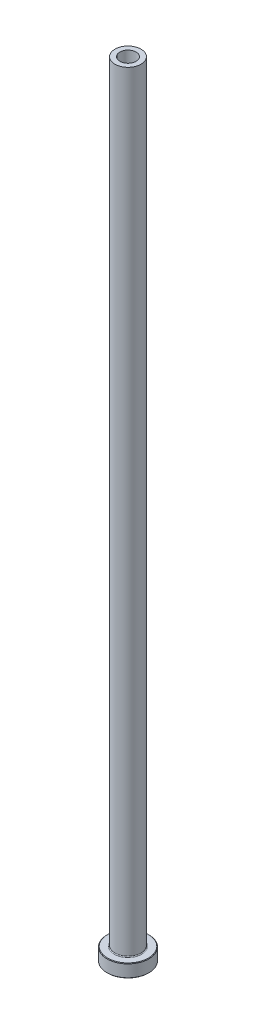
ISO-10303-21;
HEADER;
FILE_DESCRIPTION(('STEP AP214'),'2;1');
FILE_NAME('part.step','',(''),(''),'','','');
FILE_SCHEMA(('AUTOMOTIVE_DESIGN { 1 0 10303 214 1 1 1 1 }'));
ENDSEC;
DATA;
#1=APPLICATION_CONTEXT('core data for automotive mechanical design processes');
#2=APPLICATION_PROTOCOL_DEFINITION('international standard','automotive_design',2000,#1);
#3=PRODUCT_CONTEXT('',#1,'mechanical');
#4=PRODUCT('Part','Part','',(#3));
#5=PRODUCT_RELATED_PRODUCT_CATEGORY('part','',(#4));
#6=PRODUCT_DEFINITION_FORMATION('','',#4);
#7=PRODUCT_DEFINITION_CONTEXT('part definition',#1,'design');
#8=PRODUCT_DEFINITION('design','',#6,#7);
#9=PRODUCT_DEFINITION_SHAPE('','',#8);
#10=(LENGTH_UNIT() NAMED_UNIT(*) SI_UNIT(.MILLI.,.METRE.));
#11=(NAMED_UNIT(*) PLANE_ANGLE_UNIT() SI_UNIT($,.RADIAN.));
#12=(NAMED_UNIT(*) SI_UNIT($,.STERADIAN.) SOLID_ANGLE_UNIT());
#13=UNCERTAINTY_MEASURE_WITH_UNIT(LENGTH_MEASURE(1.E-05),#10,'distance_accuracy_value','');
#14=(GEOMETRIC_REPRESENTATION_CONTEXT(3) GLOBAL_UNCERTAINTY_ASSIGNED_CONTEXT((#13)) GLOBAL_UNIT_ASSIGNED_CONTEXT((#10,
#11,#12)) REPRESENTATION_CONTEXT('',''));
#15=CARTESIAN_POINT('',(0.,0.,0.));
#16=DIRECTION('',(0.,0.,1.));
#17=DIRECTION('',(1.,0.,0.));
#18=AXIS2_PLACEMENT_3D('',#15,#16,#17);
#19=CARTESIAN_POINT('',(0.,92.1876809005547,0.));
#20=DIRECTION('',(0.,1.,0.));
#21=DIRECTION('',(0.,0.,1.));
#22=AXIS2_PLACEMENT_3D('',#19,#20,#21);
#23=CYLINDRICAL_SURFACE('',#22,3.10000000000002);
#24=CARTESIAN_POINT('',(0.,300.,0.));
#25=DIRECTION('',(0.,1.,0.));
#26=DIRECTION('',(0.,0.,1.));
#27=AXIS2_PLACEMENT_3D('',#24,#25,#26);
#28=CIRCLE('',#27,3.10000000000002);
#29=CARTESIAN_POINT('',(0.,300.,3.10000000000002));
#30=VERTEX_POINT('',#29);
#31=EDGE_CURVE('E62',#30,#30,#28,.T.);
#32=ORIENTED_EDGE('',*,*,#31,.T.);
#33=EDGE_LOOP('',(#32));
#34=FACE_BOUND('',#33,.T.);
#35=CARTESIAN_POINT('',(0.,255.,0.));
#36=DIRECTION('',(0.,1.,0.));
#37=DIRECTION('',(0.,0.,1.));
#38=AXIS2_PLACEMENT_3D('',#35,#36,#37);
#39=CIRCLE('',#38,3.10000000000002);
#40=CARTESIAN_POINT('',(0.,255.,3.10000000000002));
#41=VERTEX_POINT('',#40);
#42=EDGE_CURVE('E71',#41,#41,#39,.T.);
#43=ORIENTED_EDGE('',*,*,#42,.F.);
#44=EDGE_LOOP('',(#43));
#45=FACE_BOUND('',#44,.T.);
#46=ADVANCED_FACE('F30',(#34,#45),#23,.F.);
#47=CARTESIAN_POINT('',(-3.10000000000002,300.,0.));
#48=DIRECTION('',(0.,1.,0.));
#49=DIRECTION('',(0.,0.,1.));
#50=AXIS2_PLACEMENT_3D('',#47,#48,#49);
#51=PLANE('',#50);
#52=CARTESIAN_POINT('',(0.,300.,0.));
#53=DIRECTION('',(0.,1.,0.));
#54=DIRECTION('',(0.,0.,1.));
#55=AXIS2_PLACEMENT_3D('',#52,#53,#54);
#56=CIRCLE('',#55,5.00000000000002);
#57=CARTESIAN_POINT('',(0.,300.,5.00000000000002));
#58=VERTEX_POINT('',#57);
#59=EDGE_CURVE('E65',#58,#58,#56,.T.);
#60=ORIENTED_EDGE('',*,*,#59,.T.);
#61=EDGE_LOOP('',(#60));
#62=FACE_BOUND('',#61,.T.);
#63=ORIENTED_EDGE('',*,*,#31,.F.);
#64=EDGE_LOOP('',(#63));
#65=FACE_BOUND('',#64,.T.);
#66=ADVANCED_FACE('F79',(#62,#65),#51,.T.);
#67=CARTESIAN_POINT('',(0.,92.1876809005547,0.));
#68=DIRECTION('',(0.,1.,0.));
#69=DIRECTION('',(0.,0.,1.));
#70=AXIS2_PLACEMENT_3D('',#67,#68,#69);
#71=CYLINDRICAL_SURFACE('',#70,5.00000000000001);
#72=CARTESIAN_POINT('',(0.,5.3,0.));
#73=DIRECTION('',(0.,1.,0.));
#74=DIRECTION('',(0.,0.,1.));
#75=AXIS2_PLACEMENT_3D('',#72,#73,#74);
#76=CIRCLE('',#75,5.00000000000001);
#77=CARTESIAN_POINT('',(0.,5.3,5.00000000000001));
#78=VERTEX_POINT('',#77);
#79=EDGE_CURVE('E59',#78,#78,#76,.T.);
#80=ORIENTED_EDGE('',*,*,#79,.T.);
#81=EDGE_LOOP('',(#80));
#82=FACE_BOUND('',#81,.T.);
#83=ORIENTED_EDGE('',*,*,#59,.F.);
#84=EDGE_LOOP('',(#83));
#85=FACE_BOUND('',#84,.T.);
#86=ADVANCED_FACE('F85',(#82,#85),#71,.T.);
#87=CARTESIAN_POINT('',(-4.99999999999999,5.,0.));
#88=DIRECTION('',(0.,1.,0.));
#89=DIRECTION('',(0.,0.,1.));
#90=AXIS2_PLACEMENT_3D('',#87,#88,#89);
#91=PLANE('',#90);
#92=CARTESIAN_POINT('',(0.,5.,0.));
#93=DIRECTION('',(0.,1.,0.));
#94=DIRECTION('',(0.,0.,1.));
#95=AXIS2_PLACEMENT_3D('',#92,#93,#94);
#96=CIRCLE('',#95,7.79999999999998);
#97=CARTESIAN_POINT('',(0.,5.,7.79999999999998));
#98=VERTEX_POINT('',#97);
#99=EDGE_CURVE('E53',#98,#98,#96,.T.);
#100=ORIENTED_EDGE('',*,*,#99,.T.);
#101=EDGE_LOOP('',(#100));
#102=FACE_BOUND('',#101,.T.);
#103=CARTESIAN_POINT('',(0.,5.,0.));
#104=DIRECTION('',(0.,1.,0.));
#105=DIRECTION('',(0.,0.,1.));
#106=AXIS2_PLACEMENT_3D('',#103,#104,#105);
#107=CIRCLE('',#106,5.30000000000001);
#108=CARTESIAN_POINT('',(0.,5.,5.30000000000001));
#109=VERTEX_POINT('',#108);
#110=EDGE_CURVE('E56',#109,#109,#107,.F.);
#111=ORIENTED_EDGE('',*,*,#110,.T.);
#112=EDGE_LOOP('',(#111));
#113=FACE_BOUND('',#112,.T.);
#114=ADVANCED_FACE('F111',(#102,#113),#91,.T.);
#115=CARTESIAN_POINT('',(0.,92.1876809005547,0.));
#116=DIRECTION('',(0.,1.,0.));
#117=DIRECTION('',(0.,0.,1.));
#118=AXIS2_PLACEMENT_3D('',#115,#116,#117);
#119=CYLINDRICAL_SURFACE('',#118,7.99999999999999);
#120=CARTESIAN_POINT('',(0.,4.79999999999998,0.));
#121=DIRECTION('',(0.,1.,0.));
#122=DIRECTION('',(0.,0.,1.));
#123=AXIS2_PLACEMENT_3D('',#120,#121,#122);
#124=CIRCLE('',#123,7.99999999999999);
#125=CARTESIAN_POINT('',(0.,4.79999999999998,7.99999999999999));
#126=VERTEX_POINT('',#125);
#127=EDGE_CURVE('E45',#126,#126,#124,.F.);
#128=ORIENTED_EDGE('',*,*,#127,.T.);
#129=EDGE_LOOP('',(#128));
#130=FACE_BOUND('',#129,.T.);
#131=CARTESIAN_POINT('',(0.,0.199999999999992,0.));
#132=DIRECTION('',(0.,-1.,0.));
#133=DIRECTION('',(0.,0.,-1.));
#134=AXIS2_PLACEMENT_3D('',#131,#132,#133);
#135=CIRCLE('',#134,7.99999999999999);
#136=CARTESIAN_POINT('',(0.,0.199999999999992,-7.99999999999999));
#137=VERTEX_POINT('',#136);
#138=EDGE_CURVE('E50',#137,#137,#135,.F.);
#139=ORIENTED_EDGE('',*,*,#138,.T.);
#140=EDGE_LOOP('',(#139));
#141=FACE_BOUND('',#140,.T.);
#142=ADVANCED_FACE('F108',(#130,#141),#119,.T.);
#143=CARTESIAN_POINT('',(-7.99999999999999,0.,0.));
#144=DIRECTION('',(0.,-1.,0.));
#145=DIRECTION('',(0.,0.,-1.));
#146=AXIS2_PLACEMENT_3D('',#143,#144,#145);
#147=PLANE('',#146);
#148=CARTESIAN_POINT('',(0.,0.,0.));
#149=DIRECTION('',(0.,-1.,0.));
#150=DIRECTION('',(0.,0.,-1.));
#151=AXIS2_PLACEMENT_3D('',#148,#149,#150);
#152=CIRCLE('',#151,3.84999999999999);
#153=CARTESIAN_POINT('',(0.,0.,-3.84999999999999));
#154=VERTEX_POINT('',#153);
#155=EDGE_CURVE('E37',#154,#154,#152,.F.);
#156=ORIENTED_EDGE('',*,*,#155,.T.);
#157=EDGE_LOOP('',(#156));
#158=FACE_BOUND('',#157,.T.);
#159=CARTESIAN_POINT('',(0.,0.,0.));
#160=DIRECTION('',(0.,-1.,0.));
#161=DIRECTION('',(0.,0.,-1.));
#162=AXIS2_PLACEMENT_3D('',#159,#160,#161);
#163=CIRCLE('',#162,7.80000000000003);
#164=CARTESIAN_POINT('',(0.,0.,-7.80000000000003));
#165=VERTEX_POINT('',#164);
#166=EDGE_CURVE('E41',#165,#165,#163,.T.);
#167=ORIENTED_EDGE('',*,*,#166,.T.);
#168=EDGE_LOOP('',(#167));
#169=FACE_BOUND('',#168,.T.);
#170=ADVANCED_FACE('F110',(#158,#169),#147,.T.);
#171=CARTESIAN_POINT('',(0.,92.1876809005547,0.));
#172=DIRECTION('',(0.,1.,0.));
#173=DIRECTION('',(0.,0.,1.));
#174=AXIS2_PLACEMENT_3D('',#171,#172,#173);
#175=CYLINDRICAL_SURFACE('',#174,3.35);
#176=CARTESIAN_POINT('',(0.,0.499999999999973,0.));
#177=DIRECTION('',(0.,-1.,0.));
#178=DIRECTION('',(0.,0.,-1.));
#179=AXIS2_PLACEMENT_3D('',#176,#177,#178);
#180=CIRCLE('',#179,3.35);
#181=CARTESIAN_POINT('',(0.,0.499999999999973,-3.35));
#182=VERTEX_POINT('',#181);
#183=EDGE_CURVE('E10',#182,#182,#180,.T.);
#184=ORIENTED_EDGE('',*,*,#183,.T.);
#185=EDGE_LOOP('',(#184));
#186=FACE_BOUND('',#185,.T.);
#187=CARTESIAN_POINT('',(0.,243.,0.));
#188=DIRECTION('',(0.,1.,0.));
#189=DIRECTION('',(0.,0.,1.));
#190=AXIS2_PLACEMENT_3D('',#187,#188,#189);
#191=CIRCLE('',#190,3.35000000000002);
#192=CARTESIAN_POINT('',(0.,243.,3.35000000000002));
#193=VERTEX_POINT('',#192);
#194=EDGE_CURVE('E68',#193,#193,#191,.T.);
#195=ORIENTED_EDGE('',*,*,#194,.T.);
#196=EDGE_LOOP('',(#195));
#197=FACE_BOUND('',#196,.T.);
#198=ADVANCED_FACE('F118',(#186,#197),#175,.F.);
#199=CARTESIAN_POINT('',(0.,243.,0.));
#200=DIRECTION('',(0.,-1.,0.));
#201=DIRECTION('',(0.,0.,-1.));
#202=AXIS2_PLACEMENT_3D('',#199,#200,#201);
#203=CONICAL_SURFACE('',#202,3.35000000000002,0.0208303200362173);
#204=ORIENTED_EDGE('',*,*,#42,.T.);
#205=EDGE_LOOP('',(#204));
#206=FACE_BOUND('',#205,.T.);
#207=ORIENTED_EDGE('',*,*,#194,.F.);
#208=EDGE_LOOP('',(#207));
#209=FACE_BOUND('',#208,.T.);
#210=ADVANCED_FACE('F75',(#206,#209),#203,.F.);
#211=CARTESIAN_POINT('',(0.,5.3,0.));
#212=DIRECTION('',(0.,1.,0.));
#213=DIRECTION('',(0.,0.,1.));
#214=AXIS2_PLACEMENT_3D('',#211,#212,#213);
#215=TOROIDAL_SURFACE('',#214,5.30000000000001,0.3);
#216=ORIENTED_EDGE('',*,*,#110,.F.);
#217=EDGE_LOOP('',(#216));
#218=FACE_BOUND('',#217,.T.);
#219=ORIENTED_EDGE('',*,*,#79,.F.);
#220=EDGE_LOOP('',(#219));
#221=FACE_BOUND('',#220,.T.);
#222=ADVANCED_FACE('F90',(#218,#221),#215,.F.);
#223=CARTESIAN_POINT('',(0.,5.,0.));
#224=DIRECTION('',(0.,-1.,0.));
#225=DIRECTION('',(0.,0.,-1.));
#226=AXIS2_PLACEMENT_3D('',#223,#224,#225);
#227=CONICAL_SURFACE('',#226,7.79999999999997,0.78539816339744);
#228=ORIENTED_EDGE('',*,*,#127,.F.);
#229=EDGE_LOOP('',(#228));
#230=FACE_BOUND('',#229,.T.);
#231=ORIENTED_EDGE('',*,*,#99,.F.);
#232=EDGE_LOOP('',(#231));
#233=FACE_BOUND('',#232,.T.);
#234=ADVANCED_FACE('F93',(#230,#233),#227,.T.);
#235=CARTESIAN_POINT('',(0.,0.199999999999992,0.));
#236=DIRECTION('',(0.,1.,0.));
#237=DIRECTION('',(0.,0.,1.));
#238=AXIS2_PLACEMENT_3D('',#235,#236,#237);
#239=CONICAL_SURFACE('',#238,7.99999999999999,0.78539816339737);
#240=ORIENTED_EDGE('',*,*,#166,.F.);
#241=EDGE_LOOP('',(#240));
#242=FACE_BOUND('',#241,.T.);
#243=ORIENTED_EDGE('',*,*,#138,.F.);
#244=EDGE_LOOP('',(#243));
#245=FACE_BOUND('',#244,.T.);
#246=ADVANCED_FACE('F96',(#242,#245),#239,.T.);
#247=CARTESIAN_POINT('',(0.,0.,0.));
#248=DIRECTION('',(0.,-1.,0.));
#249=DIRECTION('',(0.,0.,-1.));
#250=AXIS2_PLACEMENT_3D('',#247,#248,#249);
#251=CONICAL_SURFACE('',#250,3.84999999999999,0.785398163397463);
#252=ORIENTED_EDGE('',*,*,#183,.F.);
#253=EDGE_LOOP('',(#252));
#254=FACE_BOUND('',#253,.T.);
#255=ORIENTED_EDGE('',*,*,#155,.F.);
#256=EDGE_LOOP('',(#255));
#257=FACE_BOUND('',#256,.T.);
#258=ADVANCED_FACE('F32',(#254,#257),#251,.F.);
#259=CLOSED_SHELL('',(#46,#66,#86,#114,#142,#170,#198,#210,#222,#234,#246,#258));
#260=MANIFOLD_SOLID_BREP('B2',#259);
#261=ADVANCED_BREP_SHAPE_REPRESENTATION('',(#18,#260),#14);
#262=SHAPE_DEFINITION_REPRESENTATION(#9,#261);
ENDSEC;
END-ISO-10303-21;
